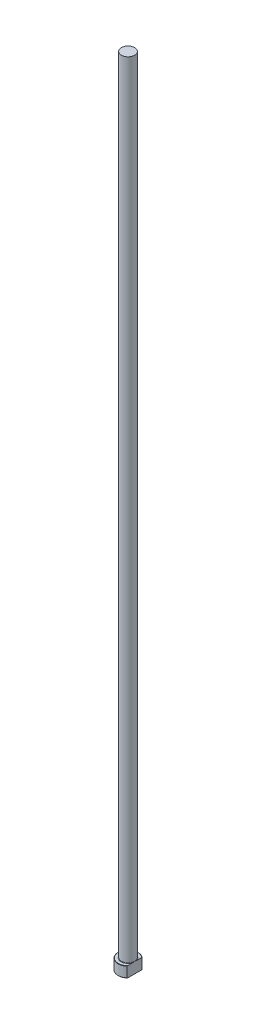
ISO-10303-21;
HEADER;
FILE_DESCRIPTION(('STEP AP214'),'2;1');
FILE_NAME('part.step','',(''),(''),'','','');
FILE_SCHEMA(('AUTOMOTIVE_DESIGN { 1 0 10303 214 1 1 1 1 }'));
ENDSEC;
DATA;
#1=APPLICATION_CONTEXT('core data for automotive mechanical design processes');
#2=APPLICATION_PROTOCOL_DEFINITION('international standard','automotive_design',2000,#1);
#3=PRODUCT_CONTEXT('',#1,'mechanical');
#4=PRODUCT('Part','Part','',(#3));
#5=PRODUCT_RELATED_PRODUCT_CATEGORY('part','',(#4));
#6=PRODUCT_DEFINITION_FORMATION('','',#4);
#7=PRODUCT_DEFINITION_CONTEXT('part definition',#1,'design');
#8=PRODUCT_DEFINITION('design','',#6,#7);
#9=PRODUCT_DEFINITION_SHAPE('','',#8);
#10=(LENGTH_UNIT() NAMED_UNIT(*) SI_UNIT(.MILLI.,.METRE.));
#11=(NAMED_UNIT(*) PLANE_ANGLE_UNIT() SI_UNIT($,.RADIAN.));
#12=(NAMED_UNIT(*) SI_UNIT($,.STERADIAN.) SOLID_ANGLE_UNIT());
#13=UNCERTAINTY_MEASURE_WITH_UNIT(LENGTH_MEASURE(1.E-05),#10,'distance_accuracy_value','');
#14=(GEOMETRIC_REPRESENTATION_CONTEXT(3) GLOBAL_UNCERTAINTY_ASSIGNED_CONTEXT((#13)) GLOBAL_UNIT_ASSIGNED_CONTEXT((#10,
#11,#12)) REPRESENTATION_CONTEXT('',''));
#15=CARTESIAN_POINT('',(0.,0.,0.));
#16=DIRECTION('',(0.,0.,1.));
#17=DIRECTION('',(1.,0.,0.));
#18=AXIS2_PLACEMENT_3D('',#15,#16,#17);
#19=CARTESIAN_POINT('',(0.,0.,0.));
#20=DIRECTION('',(0.,-1.,0.));
#21=DIRECTION('',(0.,0.,-1.));
#22=AXIS2_PLACEMENT_3D('',#19,#20,#21);
#23=PLANE('',#22);
#24=CARTESIAN_POINT('',(0.,0.,0.));
#25=DIRECTION('',(0.,-1.,0.));
#26=DIRECTION('',(0.,0.,-1.));
#27=AXIS2_PLACEMENT_3D('',#24,#25,#26);
#28=CIRCLE('',#27,7.29999999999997);
#29=CARTESIAN_POINT('',(4.99999999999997,0.,5.31883445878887));
#30=VERTEX_POINT('',#29);
#31=CARTESIAN_POINT('',(4.99999999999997,0.,-5.31883445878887));
#32=VERTEX_POINT('',#31);
#33=EDGE_CURVE('E98',#30,#32,#28,.T.);
#34=ORIENTED_EDGE('',*,*,#33,.T.);
#35=DIRECTION('',(0.,0.,1.));
#36=VECTOR('',#35,1.);
#37=CARTESIAN_POINT('',(4.99999999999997,0.,5.59016994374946));
#38=LINE('',#37,#36);
#39=EDGE_CURVE('E83',#32,#30,#38,.T.);
#40=ORIENTED_EDGE('',*,*,#39,.T.);
#41=EDGE_LOOP('',(#34,#40));
#42=FACE_BOUND('',#41,.T.);
#43=ADVANCED_FACE('F32',(#42),#23,.T.);
#44=CARTESIAN_POINT('',(0.,259.958771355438,0.));
#45=DIRECTION('',(0.,1.,0.));
#46=DIRECTION('',(0.,0.,1.));
#47=AXIS2_PLACEMENT_3D('',#44,#45,#46);
#48=CYLINDRICAL_SURFACE('',#47,7.49999999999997);
#49=CARTESIAN_POINT('',(0.,7.8000000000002,0.));
#50=DIRECTION('',(0.,1.,0.));
#51=DIRECTION('',(0.,0.,1.));
#52=AXIS2_PLACEMENT_3D('',#49,#50,#51);
#53=CIRCLE('',#52,7.49999999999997);
#54=CARTESIAN_POINT('',(4.99999999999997,7.8000000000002,5.59016994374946));
#55=VERTEX_POINT('',#54);
#56=CARTESIAN_POINT('',(4.99999999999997,7.8000000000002,-5.59016994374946));
#57=VERTEX_POINT('',#56);
#58=EDGE_CURVE('E104',#55,#57,#53,.F.);
#59=ORIENTED_EDGE('',*,*,#58,.T.);
#60=DIRECTION('',(0.,-1.,0.));
#61=VECTOR('',#60,1.);
#62=CARTESIAN_POINT('',(4.99999999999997,600.,-5.59016994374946));
#63=LINE('',#62,#61);
#64=CARTESIAN_POINT('',(4.99999999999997,0.199999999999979,-5.59016994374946));
#65=VERTEX_POINT('',#64);
#66=EDGE_CURVE('E183',#57,#65,#63,.T.);
#67=ORIENTED_EDGE('',*,*,#66,.T.);
#68=CARTESIAN_POINT('',(0.,0.199999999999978,0.));
#69=DIRECTION('',(0.,-1.,0.));
#70=DIRECTION('',(0.,0.,-1.));
#71=AXIS2_PLACEMENT_3D('',#68,#69,#70);
#72=CIRCLE('',#71,7.49999999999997);
#73=CARTESIAN_POINT('',(4.99999999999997,0.199999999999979,5.59016994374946));
#74=VERTEX_POINT('',#73);
#75=EDGE_CURVE('E100',#65,#74,#72,.F.);
#76=ORIENTED_EDGE('',*,*,#75,.T.);
#77=DIRECTION('',(0.,-1.,0.));
#78=VECTOR('',#77,1.);
#79=CARTESIAN_POINT('',(4.99999999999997,600.,5.59016994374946));
#80=LINE('',#79,#78);
#81=EDGE_CURVE('E93',#55,#74,#80,.T.);
#82=ORIENTED_EDGE('',*,*,#81,.F.);
#83=EDGE_LOOP('',(#59,#67,#76,#82));
#84=FACE_BOUND('',#83,.T.);
#85=ADVANCED_FACE('F158',(#84),#48,.T.);
#86=CARTESIAN_POINT('',(-7.49999999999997,8.,0.));
#87=DIRECTION('',(0.,1.,0.));
#88=DIRECTION('',(0.,0.,1.));
#89=AXIS2_PLACEMENT_3D('',#86,#87,#88);
#90=PLANE('',#89);
#91=CARTESIAN_POINT('',(0.,8.,0.));
#92=DIRECTION('',(0.,1.,0.));
#93=DIRECTION('',(0.,0.,1.));
#94=AXIS2_PLACEMENT_3D('',#91,#92,#93);
#95=CIRCLE('',#94,7.30000000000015);
#96=CARTESIAN_POINT('',(4.99999999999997,8.,-5.31883445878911));
#97=VERTEX_POINT('',#96);
#98=CARTESIAN_POINT('',(4.99999999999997,8.,5.31883445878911));
#99=VERTEX_POINT('',#98);
#100=EDGE_CURVE('E178',#97,#99,#95,.T.);
#101=ORIENTED_EDGE('',*,*,#100,.T.);
#102=DIRECTION('',(0.,0.,-1.));
#103=VECTOR('',#102,1.);
#104=CARTESIAN_POINT('',(4.99999999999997,8.,0.));
#105=LINE('',#104,#103);
#106=CARTESIAN_POINT('',(4.99999999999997,7.99999999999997,1.75783958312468));
#107=VERTEX_POINT('',#106);
#108=EDGE_CURVE('E57',#99,#107,#105,.T.);
#109=ORIENTED_EDGE('',*,*,#108,.T.);
#110=CARTESIAN_POINT('',(0.,8.,0.));
#111=DIRECTION('',(0.,1.,0.));
#112=DIRECTION('',(0.,0.,1.));
#113=AXIS2_PLACEMENT_3D('',#110,#111,#112);
#114=CIRCLE('',#113,5.29999999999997);
#115=CARTESIAN_POINT('',(4.99999999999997,7.99999999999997,-1.75783958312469));
#116=VERTEX_POINT('',#115);
#117=EDGE_CURVE('E107',#107,#116,#114,.F.);
#118=ORIENTED_EDGE('',*,*,#117,.T.);
#119=EDGE_CURVE('E136',#116,#97,#105,.T.);
#120=ORIENTED_EDGE('',*,*,#119,.T.);
#121=EDGE_LOOP('',(#101,#109,#118,#120));
#122=FACE_BOUND('',#121,.T.);
#123=ADVANCED_FACE('F147',(#122),#90,.T.);
#124=CARTESIAN_POINT('',(0.,8.00000000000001,0.));
#125=DIRECTION('',(0.,-1.,0.));
#126=DIRECTION('',(0.,0.,-1.));
#127=AXIS2_PLACEMENT_3D('',#124,#125,#126);
#128=CONICAL_SURFACE('',#127,7.30000000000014,0.785398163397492);
#129=ORIENTED_EDGE('',*,*,#58,.F.);
#130=CARTESIAN_POINT('',(4.99999999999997,2.02290246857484,12.2996471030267));
#131=CARTESIAN_POINT('',(4.99999999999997,2.19416619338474,12.1147698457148));
#132=CARTESIAN_POINT('',(4.99999999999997,2.3651387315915,11.9296229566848));
#133=CARTESIAN_POINT('',(4.99999999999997,2.70641198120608,11.5587086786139));
#134=CARTESIAN_POINT('',(4.99999999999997,2.8767126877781,11.3729412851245));
#135=CARTESIAN_POINT('',(4.99999999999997,3.38654214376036,10.8145105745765));
#136=CARTESIAN_POINT('',(4.99999999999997,3.72492462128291,10.4407980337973));
#137=CARTESIAN_POINT('',(4.99999999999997,4.39960399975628,9.68746107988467));
#138=CARTESIAN_POINT('',(4.99999999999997,4.73587640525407,9.30781469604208));
#139=CARTESIAN_POINT('',(4.99999999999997,5.40266300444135,8.54355414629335));
#140=CARTESIAN_POINT('',(4.99999999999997,5.73317787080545,8.15894056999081));
#141=CARTESIAN_POINT('',(4.99999999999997,6.32050616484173,7.4605234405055));
#142=CARTESIAN_POINT('',(4.99999999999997,6.57881367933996,7.14797875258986));
#143=CARTESIAN_POINT('',(4.99999999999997,7.08815745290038,6.51684714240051));
#144=CARTESIAN_POINT('',(4.99999999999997,7.33919194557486,6.19825878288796));
#145=CARTESIAN_POINT('',(4.99999999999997,7.70761642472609,5.71446312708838));
#146=CARTESIAN_POINT('',(4.99999999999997,7.82900589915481,5.55230264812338));
#147=CARTESIAN_POINT('',(4.99999999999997,8.06851378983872,5.22558802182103));
#148=CARTESIAN_POINT('',(4.99999999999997,8.18663235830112,5.06103398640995));
#149=CARTESIAN_POINT('',(4.99999999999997,8.41879851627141,4.72916340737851));
#150=CARTESIAN_POINT('',(4.99999999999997,8.53284764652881,4.56184794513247));
#151=CARTESIAN_POINT('',(4.99999999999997,8.7559029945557,4.22389957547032));
#152=CARTESIAN_POINT('',(4.99999999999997,8.86490976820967,4.05326703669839));
#153=CARTESIAN_POINT('',(4.99999999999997,9.07352802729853,3.71301730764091));
#154=CARTESIAN_POINT('',(4.99999999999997,9.17331912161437,3.54351083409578));
#155=CARTESIAN_POINT('',(4.99999999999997,9.36528183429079,3.20017857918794));
#156=CARTESIAN_POINT('',(4.99999999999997,9.4574526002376,3.02635231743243));
#157=CARTESIAN_POINT('',(4.99999999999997,9.63197812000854,2.67392882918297));
#158=CARTESIAN_POINT('',(4.99999999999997,9.71433885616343,2.49533459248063));
#159=CARTESIAN_POINT('',(4.99999999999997,9.86657328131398,2.13287211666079));
#160=CARTESIAN_POINT('',(4.99999999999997,9.93645048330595,1.94900537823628));
#161=CARTESIAN_POINT('',(4.99999999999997,10.0468845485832,1.61681363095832));
#162=CARTESIAN_POINT('',(4.99999999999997,10.0905114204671,1.46951511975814));
#163=CARTESIAN_POINT('',(4.99999999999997,10.1664777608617,1.17205123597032));
#164=CARTESIAN_POINT('',(4.99999999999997,10.1988213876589,1.02188694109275));
#165=CARTESIAN_POINT('',(4.99999999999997,10.2506360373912,0.719811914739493));
#166=CARTESIAN_POINT('',(4.99999999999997,10.270147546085,0.567908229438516));
#167=CARTESIAN_POINT('',(4.99999999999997,10.2953955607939,0.262949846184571));
#168=CARTESIAN_POINT('',(4.99999999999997,10.3011328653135,0.109895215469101));
#169=CARTESIAN_POINT('',(4.99999999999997,10.2984919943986,-0.196515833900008));
#170=CARTESIAN_POINT('',(4.99999999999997,10.290074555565,-0.349871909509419));
#171=CARTESIAN_POINT('',(4.99999999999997,10.2595435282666,-0.655203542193));
#172=CARTESIAN_POINT('',(4.99999999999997,10.2374288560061,-0.807178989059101));
#173=CARTESIAN_POINT('',(4.99999999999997,10.1805990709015,-1.10921231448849));
#174=CARTESIAN_POINT('',(4.99999999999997,10.1458448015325,-1.25926271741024));
#175=CARTESIAN_POINT('',(4.99999999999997,10.0653312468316,-1.55634789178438));
#176=CARTESIAN_POINT('',(4.99999999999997,10.019571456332,-1.70338252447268));
#177=CARTESIAN_POINT('',(4.99999999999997,9.91304201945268,-2.0105606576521));
#178=CARTESIAN_POINT('',(4.99999999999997,9.85116243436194,-2.17031597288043));
#179=CARTESIAN_POINT('',(4.99999999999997,9.71797424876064,-2.48585686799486));
#180=CARTESIAN_POINT('',(4.99999999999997,9.646662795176,-2.64164122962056));
#181=CARTESIAN_POINT('',(4.99999999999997,9.49630859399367,-2.94973647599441));
#182=CARTESIAN_POINT('',(4.99999999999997,9.4172527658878,-3.10204092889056));
#183=CARTESIAN_POINT('',(4.99999999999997,9.25299983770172,-3.40325483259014));
#184=CARTESIAN_POINT('',(4.99999999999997,9.16780351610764,-3.55216471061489));
#185=CARTESIAN_POINT('',(4.99999999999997,8.99132919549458,-3.84886097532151));
#186=CARTESIAN_POINT('',(4.99999999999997,8.89998823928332,-3.99660974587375));
#187=CARTESIAN_POINT('',(4.99999999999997,8.7131451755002,-4.2894450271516));
#188=CARTESIAN_POINT('',(4.99999999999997,8.61764297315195,-4.43453147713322));
#189=CARTESIAN_POINT('',(4.99999999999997,8.32624270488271,-4.86605322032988));
#190=CARTESIAN_POINT('',(4.99999999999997,8.12526518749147,-5.1490561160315));
#191=CARTESIAN_POINT('',(4.99999999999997,7.6894794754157,-5.74150232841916));
#192=CARTESIAN_POINT('',(4.99999999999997,7.45349590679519,-6.05007152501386));
#193=CARTESIAN_POINT('',(4.99999999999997,6.97343103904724,-6.66088013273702));
#194=CARTESIAN_POINT('',(4.99999999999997,6.72934863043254,-6.96311866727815));
#195=CARTESIAN_POINT('',(4.99999999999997,6.23516699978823,-7.56307522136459));
#196=CARTESIAN_POINT('',(4.99999999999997,5.98506253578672,-7.86078890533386));
#197=CARTESIAN_POINT('',(4.99999999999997,5.48054649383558,-8.45254667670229));
#198=CARTESIAN_POINT('',(4.99999999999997,5.22613481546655,-8.74659067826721));
#199=CARTESIAN_POINT('',(4.99999999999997,4.72865534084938,-9.31510244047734));
#200=CARTESIAN_POINT('',(4.99999999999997,4.48576913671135,-9.58972942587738));
#201=CARTESIAN_POINT('',(4.99999999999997,3.99769198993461,-10.1369350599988));
#202=CARTESIAN_POINT('',(4.99999999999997,3.75250100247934,-10.4095136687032));
#203=CARTESIAN_POINT('',(4.99999999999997,3.26075538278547,-10.952472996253));
#204=CARTESIAN_POINT('',(4.99999999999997,3.01420432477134,-11.2228569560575));
#205=CARTESIAN_POINT('',(4.99999999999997,2.51960108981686,-11.762227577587));
#206=CARTESIAN_POINT('',(4.99999999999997,2.27154897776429,-12.0312142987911));
#207=CARTESIAN_POINT('',(4.99999999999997,2.02290246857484,-12.2996471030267));
#208=B_SPLINE_CURVE_WITH_KNOTS('',3,(#130,#131,#132,#133,#134,#135,#136,#137,#138,#139,#140,
#141,#142,#143,#144,#145,#146,#147,#148,#149,#150,#151,#152,#153,#154,#155,#156,#157,#158,#159,
#160,#161,#162,#163,#164,#165,#166,#167,#168,#169,#170,#171,#172,#173,#174,#175,#176,#177,#178,
#179,#180,#181,#182,#183,#184,#185,#186,#187,#188,#189,#190,#191,#192,#193,#194,#195,#196,#197,
#198,#199,#200,#201,#202,#203,#204,#205,#206,#207),.UNSPECIFIED.,.F.,.F.,(4,2,2,2,2,2,2,2,2,2,2,
2,2,2,2,2,2,2,2,2,2,2,2,2,2,2,2,2,2,2,2,2,2,2,2,2,2,2,4),(0.,0.756040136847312,1.5120857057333,
3.02450144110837,4.54594242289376,6.0672044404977,7.28354986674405,8.50018826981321,
9.10784347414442,9.7154703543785,10.3228646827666,10.9301918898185,11.5201366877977,
12.110147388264,12.6997964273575,13.2892792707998,13.7497741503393,14.2100991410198,
14.6689647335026,15.1278037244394,15.5879175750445,16.0480678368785,16.5096559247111,
16.9712652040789,17.4848523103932,17.9985951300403,18.5132211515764,19.0277820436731,
19.5488073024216,20.0698444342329,21.1108480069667,22.2760591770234,23.4414306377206,
24.6078560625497,25.7743087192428,26.8741673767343,27.9740474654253,29.0717909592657,
30.1694873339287),.UNSPECIFIED.);
#209=EDGE_CURVE('E135',#55,#99,#208,.T.);
#210=ORIENTED_EDGE('',*,*,#209,.T.);
#211=ORIENTED_EDGE('',*,*,#100,.F.);
#212=EDGE_CURVE('E127',#97,#57,#208,.T.);
#213=ORIENTED_EDGE('',*,*,#212,.T.);
#214=EDGE_LOOP('',(#129,#210,#211,#213));
#215=FACE_BOUND('',#214,.T.);
#216=ADVANCED_FACE('F143',(#215),#128,.T.);
#217=CARTESIAN_POINT('',(0.,0.199999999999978,0.));
#218=DIRECTION('',(0.,1.,0.));
#219=DIRECTION('',(0.,0.,1.));
#220=AXIS2_PLACEMENT_3D('',#217,#218,#219);
#221=CONICAL_SURFACE('',#220,7.49999999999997,0.785398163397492);
#222=ORIENTED_EDGE('',*,*,#75,.F.);
#223=CARTESIAN_POINT('',(4.99999999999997,5.97709753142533,-12.2996471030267));
#224=CARTESIAN_POINT('',(4.99999999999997,5.80583380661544,-12.1147698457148));
#225=CARTESIAN_POINT('',(4.99999999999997,5.63486126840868,-11.9296229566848));
#226=CARTESIAN_POINT('',(4.99999999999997,5.29358801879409,-11.5587086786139));
#227=CARTESIAN_POINT('',(4.99999999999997,5.12328731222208,-11.3729412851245));
#228=CARTESIAN_POINT('',(4.99999999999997,4.61345785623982,-10.8145105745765));
#229=CARTESIAN_POINT('',(4.99999999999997,4.27507537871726,-10.4407980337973));
#230=CARTESIAN_POINT('',(4.99999999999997,3.6003960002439,-9.68746107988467));
#231=CARTESIAN_POINT('',(4.99999999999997,3.2641235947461,-9.30781469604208));
#232=CARTESIAN_POINT('',(4.99999999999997,2.59733699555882,-8.54355414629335));
#233=CARTESIAN_POINT('',(4.99999999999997,2.26682212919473,-8.15894056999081));
#234=CARTESIAN_POINT('',(4.99999999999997,1.67949383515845,-7.4605234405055));
#235=CARTESIAN_POINT('',(4.99999999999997,1.42118632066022,-7.14797875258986));
#236=CARTESIAN_POINT('',(4.99999999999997,0.911842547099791,-6.51684714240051));
#237=CARTESIAN_POINT('',(4.99999999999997,0.660808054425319,-6.19825878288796));
#238=CARTESIAN_POINT('',(4.99999999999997,0.292383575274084,-5.71446312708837));
#239=CARTESIAN_POINT('',(4.99999999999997,0.170994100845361,-5.55230264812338));
#240=CARTESIAN_POINT('',(4.99999999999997,-0.0685137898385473,-5.22558802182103));
#241=CARTESIAN_POINT('',(4.99999999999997,-0.186632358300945,-5.06103398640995));
#242=CARTESIAN_POINT('',(4.99999999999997,-0.418798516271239,-4.7291634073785));
#243=CARTESIAN_POINT('',(4.99999999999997,-0.532847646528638,-4.56184794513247));
#244=CARTESIAN_POINT('',(4.99999999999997,-0.755902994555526,-4.22389957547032));
#245=CARTESIAN_POINT('',(4.99999999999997,-0.864909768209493,-4.05326703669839));
#246=CARTESIAN_POINT('',(4.99999999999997,-1.07352802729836,-3.71301730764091));
#247=CARTESIAN_POINT('',(4.99999999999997,-1.17331912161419,-3.54351083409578));
#248=CARTESIAN_POINT('',(4.99999999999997,-1.36528183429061,-3.20017857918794));
#249=CARTESIAN_POINT('',(4.99999999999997,-1.45745260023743,-3.02635231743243));
#250=CARTESIAN_POINT('',(4.99999999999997,-1.63197812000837,-2.67392882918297));
#251=CARTESIAN_POINT('',(4.99999999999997,-1.71433885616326,-2.49533459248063));
#252=CARTESIAN_POINT('',(4.99999999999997,-1.8665732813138,-2.13287211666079));
#253=CARTESIAN_POINT('',(4.99999999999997,-1.93645048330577,-1.94900537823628));
#254=CARTESIAN_POINT('',(4.99999999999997,-2.04688454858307,-1.61681363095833));
#255=CARTESIAN_POINT('',(4.99999999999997,-2.09051142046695,-1.46951511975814));
#256=CARTESIAN_POINT('',(4.99999999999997,-2.16647776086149,-1.17205123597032));
#257=CARTESIAN_POINT('',(4.99999999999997,-2.19882138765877,-1.02188694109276));
#258=CARTESIAN_POINT('',(4.99999999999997,-2.250636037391,-0.719811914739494));
#259=CARTESIAN_POINT('',(4.99999999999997,-2.27014754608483,-0.567908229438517));
#260=CARTESIAN_POINT('',(4.99999999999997,-2.29539556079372,-0.262949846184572));
#261=CARTESIAN_POINT('',(4.99999999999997,-2.30113286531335,-0.109895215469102));
#262=CARTESIAN_POINT('',(4.99999999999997,-2.29849199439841,0.196515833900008));
#263=CARTESIAN_POINT('',(4.99999999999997,-2.29007455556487,0.349871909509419));
#264=CARTESIAN_POINT('',(4.99999999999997,-2.25954352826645,0.655203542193));
#265=CARTESIAN_POINT('',(4.99999999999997,-2.23742885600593,0.807178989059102));
#266=CARTESIAN_POINT('',(4.99999999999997,-2.18059907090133,1.10921231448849));
#267=CARTESIAN_POINT('',(4.99999999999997,-2.14584480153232,1.25926271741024));
#268=CARTESIAN_POINT('',(4.99999999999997,-2.06533124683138,1.55634789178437));
#269=CARTESIAN_POINT('',(4.99999999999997,-2.01957145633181,1.70338252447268));
#270=CARTESIAN_POINT('',(4.99999999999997,-1.9130420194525,2.0105606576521));
#271=CARTESIAN_POINT('',(4.99999999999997,-1.85116243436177,2.17031597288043));
#272=CARTESIAN_POINT('',(4.99999999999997,-1.71797424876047,2.48585686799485));
#273=CARTESIAN_POINT('',(4.99999999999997,-1.64666279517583,2.64164122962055));
#274=CARTESIAN_POINT('',(4.99999999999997,-1.4963085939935,2.94973647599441));
#275=CARTESIAN_POINT('',(4.99999999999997,-1.41725276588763,3.10204092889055));
#276=CARTESIAN_POINT('',(4.99999999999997,-1.25299983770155,3.40325483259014));
#277=CARTESIAN_POINT('',(4.99999999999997,-1.16780351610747,3.55216471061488));
#278=CARTESIAN_POINT('',(4.99999999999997,-0.991329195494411,3.8488609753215));
#279=CARTESIAN_POINT('',(4.99999999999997,-0.899988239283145,3.99660974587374));
#280=CARTESIAN_POINT('',(4.99999999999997,-0.71314517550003,4.2894450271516));
#281=CARTESIAN_POINT('',(4.99999999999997,-0.617642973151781,4.43453147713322));
#282=CARTESIAN_POINT('',(4.99999999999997,-0.326242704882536,4.86605322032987));
#283=CARTESIAN_POINT('',(4.99999999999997,-0.125265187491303,5.14905611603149));
#284=CARTESIAN_POINT('',(4.99999999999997,0.310520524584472,5.74150232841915));
#285=CARTESIAN_POINT('',(4.99999999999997,0.546504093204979,6.05007152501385));
#286=CARTESIAN_POINT('',(4.99999999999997,1.02656896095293,6.66088013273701));
#287=CARTESIAN_POINT('',(4.99999999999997,1.27065136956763,6.96311866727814));
#288=CARTESIAN_POINT('',(4.99999999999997,1.76483300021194,7.56307522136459));
#289=CARTESIAN_POINT('',(4.99999999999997,2.01493746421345,7.86078890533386));
#290=CARTESIAN_POINT('',(4.99999999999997,2.51945350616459,8.45254667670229));
#291=CARTESIAN_POINT('',(4.99999999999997,2.77386518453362,8.74659067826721));
#292=CARTESIAN_POINT('',(4.99999999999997,3.27134465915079,9.31510244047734));
#293=CARTESIAN_POINT('',(4.99999999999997,3.51423086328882,9.58972942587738));
#294=CARTESIAN_POINT('',(4.99999999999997,4.00230801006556,10.1369350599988));
#295=CARTESIAN_POINT('',(4.99999999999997,4.24749899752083,10.4095136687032));
#296=CARTESIAN_POINT('',(4.99999999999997,4.7392446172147,10.952472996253));
#297=CARTESIAN_POINT('',(4.99999999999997,4.98579567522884,11.2228569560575));
#298=CARTESIAN_POINT('',(4.99999999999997,5.48039891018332,11.762227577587));
#299=CARTESIAN_POINT('',(4.99999999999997,5.72845102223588,12.0312142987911));
#300=CARTESIAN_POINT('',(4.99999999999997,5.97709753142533,12.2996471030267));
#301=B_SPLINE_CURVE_WITH_KNOTS('',3,(#223,#224,#225,#226,#227,#228,#229,#230,#231,#232,#233,
#234,#235,#236,#237,#238,#239,#240,#241,#242,#243,#244,#245,#246,#247,#248,#249,#250,#251,#252,
#253,#254,#255,#256,#257,#258,#259,#260,#261,#262,#263,#264,#265,#266,#267,#268,#269,#270,#271,
#272,#273,#274,#275,#276,#277,#278,#279,#280,#281,#282,#283,#284,#285,#286,#287,#288,#289,#290,
#291,#292,#293,#294,#295,#296,#297,#298,#299,#300),.UNSPECIFIED.,.F.,.F.,(4,2,2,2,2,2,2,2,2,2,2,
2,2,2,2,2,2,2,2,2,2,2,2,2,2,2,2,2,2,2,2,2,2,2,2,2,2,2,4),(0.,0.756040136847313,1.5120857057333,
3.02450144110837,4.54594242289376,6.0672044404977,7.28354986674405,8.50018826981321,
9.10784347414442,9.71547035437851,10.3228646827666,10.9301918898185,11.5201366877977,
12.110147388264,12.6997964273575,13.2892792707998,13.7497741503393,14.2100991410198,
14.6689647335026,15.1278037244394,15.5879175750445,16.0480678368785,16.5096559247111,
16.9712652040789,17.4848523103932,17.9985951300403,18.5132211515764,19.0277820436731,
19.5488073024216,20.0698444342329,21.1108480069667,22.2760591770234,23.4414306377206,
24.6078560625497,25.7743087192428,26.8741673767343,27.9740474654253,29.0717909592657,
30.1694873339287),.UNSPECIFIED.);
#302=EDGE_CURVE('E86',#65,#32,#301,.T.);
#303=ORIENTED_EDGE('',*,*,#302,.T.);
#304=ORIENTED_EDGE('',*,*,#33,.F.);
#305=EDGE_CURVE('E89',#30,#74,#301,.T.);
#306=ORIENTED_EDGE('',*,*,#305,.T.);
#307=EDGE_LOOP('',(#222,#303,#304,#306));
#308=FACE_BOUND('',#307,.T.);
#309=ADVANCED_FACE('F97',(#308),#221,.T.);
#310=CARTESIAN_POINT('',(0.,8.29999999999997,0.));
#311=DIRECTION('',(0.,1.,0.));
#312=DIRECTION('',(0.,0.,1.));
#313=AXIS2_PLACEMENT_3D('',#310,#311,#312);
#314=TOROIDAL_SURFACE('',#313,5.29999999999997,0.3);
#315=CARTESIAN_POINT('',(4.99999999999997,8.29999999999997,0.));
#316=CARTESIAN_POINT('',(4.99999999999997,8.30000062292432,1.3146948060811E-10));
#317=CARTESIAN_POINT('',(4.99999999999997,8.30000124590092,-2.52759224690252E-07));
#318=CARTESIAN_POINT('',(4.99999999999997,8.30000240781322,-9.47164357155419E-07));
#319=CARTESIAN_POINT('',(4.99999999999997,8.30000293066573,-1.40594039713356E-06));
#320=CARTESIAN_POINT('',(4.99999999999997,8.30000402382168,-2.50637608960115E-06));
#321=CARTESIAN_POINT('',(4.99999999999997,8.30000457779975,-3.16588911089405E-06));
#322=CARTESIAN_POINT('',(4.99999999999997,8.30000556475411,-4.52859968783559E-06));
#323=CARTESIAN_POINT('',(4.99999999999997,8.30000600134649,-5.22939450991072E-06));
#324=CARTESIAN_POINT('',(4.99999999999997,8.30000763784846,-7.96121989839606E-06));
#325=CARTESIAN_POINT('',(4.99999999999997,8.30000875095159,-1.00477409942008E-05));
#326=CARTESIAN_POINT('',(4.99999999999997,8.30001056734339,-1.41660874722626E-05));
#327=CARTESIAN_POINT('',(4.99999999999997,8.30001129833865,-1.61861784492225E-05));
#328=CARTESIAN_POINT('',(4.99999999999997,8.30001439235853,-2.4786574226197E-05));
#329=CARTESIAN_POINT('',(4.99999999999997,8.30001672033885,-3.13830284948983E-05));
#330=CARTESIAN_POINT('',(4.99999999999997,8.30002012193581,-4.3808422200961E-05));
#331=CARTESIAN_POINT('',(4.99999999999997,8.30002133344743,-4.95992740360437E-05));
#332=CARTESIAN_POINT('',(4.99999999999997,8.30003020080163,-9.27862616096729E-05));
#333=CARTESIAN_POINT('',(4.99999999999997,8.30003696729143,-0.000130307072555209));
#334=CARTESIAN_POINT('',(4.99999999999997,8.30006659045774,-0.000278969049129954));
#335=CARTESIAN_POINT('',(4.99999999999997,8.30009481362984,-0.000389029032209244));
#336=CARTESIAN_POINT('',(4.99999999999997,8.30020506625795,-0.000826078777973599));
#337=CARTESIAN_POINT('',(4.99999999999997,8.3002836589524,-0.00115365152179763));
#338=CARTESIAN_POINT('',(4.99999999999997,8.30059919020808,-0.00245925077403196));
#339=CARTESIAN_POINT('',(4.99999999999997,8.30084048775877,-0.00343651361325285));
#340=CARTESIAN_POINT('',(4.99999999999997,8.30184626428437,-0.00752058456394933));
#341=CARTESIAN_POINT('',(4.99999999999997,8.3026052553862,-0.0106283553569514));
#342=CARTESIAN_POINT('',(4.99999999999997,8.30996461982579,-0.0407482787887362));
#343=CARTESIAN_POINT('',(4.99999999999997,8.31658985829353,-0.0677561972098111));
#344=CARTESIAN_POINT('',(4.99999999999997,8.32953319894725,-0.120688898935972));
#345=CARTESIAN_POINT('',(4.99999999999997,8.33585289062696,-0.146613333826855));
#346=CARTESIAN_POINT('',(4.99999999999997,8.34926050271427,-0.201795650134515));
#347=CARTESIAN_POINT('',(4.99999999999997,8.35634306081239,-0.231054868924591));
#348=CARTESIAN_POINT('',(4.99999999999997,8.37050252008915,-0.289917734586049));
#349=CARTESIAN_POINT('',(4.99999999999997,8.3775784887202,-0.319521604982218));
#350=CARTESIAN_POINT('',(4.99999999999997,8.39452602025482,-0.391032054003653));
#351=CARTESIAN_POINT('',(4.99999999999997,8.40434071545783,-0.432952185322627));
#352=CARTESIAN_POINT('',(4.99999999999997,8.42340141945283,-0.515763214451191));
#353=CARTESIAN_POINT('',(4.99999999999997,8.43265559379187,-0.556652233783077));
#354=CARTESIAN_POINT('',(4.99999999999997,8.45710553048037,-0.667075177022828));
#355=CARTESIAN_POINT('',(4.99999999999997,8.47194176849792,-0.736689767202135));
#356=CARTESIAN_POINT('',(4.99999999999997,8.50018229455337,-0.876836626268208));
#357=CARTESIAN_POINT('',(4.99999999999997,8.51357312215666,-0.947371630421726));
#358=CARTESIAN_POINT('',(4.99999999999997,8.53930921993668,-1.09497328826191));
#359=CARTESIAN_POINT('',(4.99999999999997,8.55146217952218,-1.17207432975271));
#360=CARTESIAN_POINT('',(4.99999999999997,8.5723966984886,-1.32672649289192));
#361=CARTESIAN_POINT('',(4.99999999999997,8.58117877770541,-1.4042775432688));
#362=CARTESIAN_POINT('',(4.99999999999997,8.59499725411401,-1.56873827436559));
#363=CARTESIAN_POINT('',(4.99999999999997,8.59948802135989,-1.65570044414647));
#364=CARTESIAN_POINT('',(4.99999999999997,8.60018885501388,-1.78535304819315));
#365=CARTESIAN_POINT('',(4.99999999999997,8.59945214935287,-1.82802575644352));
#366=CARTESIAN_POINT('',(4.99999999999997,8.59559364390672,-1.91325081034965));
#367=CARTESIAN_POINT('',(4.99999999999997,8.59247319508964,-1.95580321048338));
#368=CARTESIAN_POINT('',(4.99999999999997,8.58383242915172,-2.03512365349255));
#369=CARTESIAN_POINT('',(4.99999999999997,8.57867386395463,-2.07192937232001));
#370=CARTESIAN_POINT('',(4.99999999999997,8.56543793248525,-2.14526756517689));
#371=CARTESIAN_POINT('',(4.99999999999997,8.55734203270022,-2.18179676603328));
#372=CARTESIAN_POINT('',(4.99999999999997,8.53718005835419,-2.25427226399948));
#373=CARTESIAN_POINT('',(4.99999999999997,8.52507057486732,-2.29020746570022));
#374=CARTESIAN_POINT('',(4.99999999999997,8.5027092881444,-2.34223029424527));
#375=CARTESIAN_POINT('',(4.99999999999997,8.49457811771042,-2.35922314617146));
#376=CARTESIAN_POINT('',(4.99999999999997,8.47657809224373,-2.39224900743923));
#377=CARTESIAN_POINT('',(4.99999999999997,8.46671281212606,-2.40828390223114));
#378=CARTESIAN_POINT('',(4.99999999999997,8.44695893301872,-2.43579467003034));
#379=CARTESIAN_POINT('',(4.99999999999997,8.4374587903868,-2.44754592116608));
#380=CARTESIAN_POINT('',(4.99999999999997,8.41677914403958,-2.4694647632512));
#381=CARTESIAN_POINT('',(4.99999999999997,8.40560543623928,-2.47963758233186));
#382=CARTESIAN_POINT('',(4.99999999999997,8.38617750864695,-2.49393642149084));
#383=CARTESIAN_POINT('',(4.99999999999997,8.37851643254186,-2.49886271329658));
#384=CARTESIAN_POINT('',(4.99999999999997,8.36252740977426,-2.50749953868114));
#385=CARTESIAN_POINT('',(4.99999999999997,8.35419984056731,-2.51121075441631));
#386=CARTESIAN_POINT('',(4.99999999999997,8.33690648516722,-2.5171294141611));
#387=CARTESIAN_POINT('',(4.99999999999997,8.32793451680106,-2.51931927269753));
#388=CARTESIAN_POINT('',(4.99999999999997,8.30973576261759,-2.52185978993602));
#389=CARTESIAN_POINT('',(4.99999999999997,8.30050931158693,-2.52221275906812));
#390=CARTESIAN_POINT('',(4.99999999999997,8.2834916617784,-2.52112455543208));
#391=CARTESIAN_POINT('',(4.99999999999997,8.27568322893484,-2.51993178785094));
#392=CARTESIAN_POINT('',(4.99999999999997,8.26036860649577,-2.51628294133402));
#393=CARTESIAN_POINT('',(4.99999999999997,8.25286261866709,-2.51382603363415));
#394=CARTESIAN_POINT('',(4.99999999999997,8.2359026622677,-2.50685484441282));
#395=CARTESIAN_POINT('',(4.99999999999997,8.22661875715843,-2.50192984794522));
#396=CARTESIAN_POINT('',(4.99999999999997,8.20895514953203,-2.4906654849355));
#397=CARTESIAN_POINT('',(4.99999999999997,8.20057756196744,-2.48432291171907));
#398=CARTESIAN_POINT('',(4.99999999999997,8.1798700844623,-2.46645212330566));
#399=CARTESIAN_POINT('',(4.99999999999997,8.16824151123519,-2.45411867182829));
#400=CARTESIAN_POINT('',(4.99999999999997,8.1469246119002,-2.42790849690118));
#401=CARTESIAN_POINT('',(4.99999999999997,8.13723987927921,-2.41402898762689));
#402=CARTESIAN_POINT('',(4.99999999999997,8.11080706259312,-2.37143175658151));
#403=CARTESIAN_POINT('',(4.99999999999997,8.09628770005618,-2.34134703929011));
#404=CARTESIAN_POINT('',(4.99999999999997,8.07130349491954,-2.27940731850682));
#405=CARTESIAN_POINT('',(4.99999999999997,8.06087110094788,-2.24754035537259));
#406=CARTESIAN_POINT('',(4.99999999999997,8.03890359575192,-2.16787245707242));
#407=CARTESIAN_POINT('',(4.99999999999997,8.02913523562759,-2.11959065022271));
#408=CARTESIAN_POINT('',(4.99999999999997,8.01416953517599,-2.02224928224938));
#409=CARTESIAN_POINT('',(4.99999999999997,8.00898637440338,-1.97318778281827));
#410=CARTESIAN_POINT('',(4.99999999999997,8.00220823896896,-1.87635767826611));
#411=CARTESIAN_POINT('',(4.99999999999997,8.00050709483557,-1.82859609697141));
#412=CARTESIAN_POINT('',(4.99999999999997,7.99969104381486,-1.73330165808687));
#413=CARTESIAN_POINT('',(4.99999999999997,8.00056327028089,-1.68576884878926));
#414=CARTESIAN_POINT('',(4.99999999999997,8.00484296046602,-1.57937770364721));
#415=CARTESIAN_POINT('',(4.99999999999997,8.00880932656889,-1.52054285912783));
#416=CARTESIAN_POINT('',(4.99999999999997,8.01925964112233,-1.4031297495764));
#417=CARTESIAN_POINT('',(4.99999999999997,8.02574264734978,-1.34455139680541));
#418=CARTESIAN_POINT('',(4.99999999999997,8.0409008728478,-1.22627662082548));
#419=CARTESIAN_POINT('',(4.99999999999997,8.04962425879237,-1.16658647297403));
#420=CARTESIAN_POINT('',(4.99999999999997,8.0687792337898,-1.04732463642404));
#421=CARTESIAN_POINT('',(4.99999999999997,8.0792152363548,-0.987753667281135));
#422=CARTESIAN_POINT('',(4.99999999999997,8.10551698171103,-0.846936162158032));
#423=CARTESIAN_POINT('',(4.99999999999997,8.12196565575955,-0.765799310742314));
#424=CARTESIAN_POINT('',(4.99999999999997,8.15639716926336,-0.604819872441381));
#425=CARTESIAN_POINT('',(4.99999999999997,8.1743605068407,-0.524973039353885));
#426=CARTESIAN_POINT('',(4.99999999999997,8.20921667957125,-0.374726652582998));
#427=CARTESIAN_POINT('',(4.99999999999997,8.22599388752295,-0.304300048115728));
#428=CARTESIAN_POINT('',(4.99999999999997,8.25191105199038,-0.196907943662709));
#429=CARTESIAN_POINT('',(4.99999999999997,8.26090146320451,-0.15990571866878));
#430=CARTESIAN_POINT('',(4.99999999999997,8.27881854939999,-0.0865164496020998));
#431=CARTESIAN_POINT('',(4.99999999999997,8.28774391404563,-0.0501291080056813));
#432=CARTESIAN_POINT('',(4.99999999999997,8.29739627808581,-0.0106218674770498));
#433=CARTESIAN_POINT('',(4.99999999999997,8.29815688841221,-0.00750762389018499));
#434=CARTESIAN_POINT('',(4.99999999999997,8.29916304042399,-0.00342209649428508));
#435=CARTESIAN_POINT('',(4.99999999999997,8.29940309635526,-0.00244985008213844));
#436=CARTESIAN_POINT('',(4.99999999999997,8.29971711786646,-0.00115049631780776));
#437=CARTESIAN_POINT('',(4.99999999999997,8.29979541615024,-0.000824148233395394));
#438=CARTESIAN_POINT('',(4.99999999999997,8.29990531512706,-0.000388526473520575));
#439=CARTESIAN_POINT('',(4.99999999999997,8.29993348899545,-0.000278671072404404));
#440=CARTESIAN_POINT('',(4.99999999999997,8.2999630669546,-0.000130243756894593));
#441=CARTESIAN_POINT('',(4.99999999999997,8.29996982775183,-9.27511380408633E-05));
#442=CARTESIAN_POINT('',(4.99999999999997,8.29997868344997,-4.95929890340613E-05));
#443=CARTESIAN_POINT('',(4.99999999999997,8.29997989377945,-4.38036556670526E-05));
#444=CARTESIAN_POINT('',(4.99999999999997,8.29998329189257,-3.1381418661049E-05));
#445=CARTESIAN_POINT('',(4.99999999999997,8.2999856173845,-2.47865220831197E-05));
#446=CARTESIAN_POINT('',(4.99999999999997,8.29998870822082,-1.61877547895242E-05));
#447=CARTESIAN_POINT('',(4.99999999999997,8.29998943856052,-1.4167776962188E-05));
#448=CARTESIAN_POINT('',(4.99999999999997,8.29999125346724,-1.00495531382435E-05));
#449=CARTESIAN_POINT('',(4.99999999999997,8.29999236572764,-7.96302663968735E-06));
#450=CARTESIAN_POINT('',(4.99999999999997,8.29999400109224,-5.23107421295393E-06));
#451=CARTESIAN_POINT('',(4.99999999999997,8.29999443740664,-4.53021037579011E-06));
#452=CARTESIAN_POINT('',(4.99999999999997,8.29999542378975,-3.16731158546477E-06));
#453=CARTESIAN_POINT('',(4.99999999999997,8.29999597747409,-2.5076772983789E-06));
#454=CARTESIAN_POINT('',(4.99999999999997,8.29999707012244,-1.406958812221E-06));
#455=CARTESIAN_POINT('',(4.99999999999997,8.29999759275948,-9.48032461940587E-07));
#456=CARTESIAN_POINT('',(4.99999999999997,8.29999875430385,-2.53244332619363E-07));
#457=CARTESIAN_POINT('',(4.99999999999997,8.29999937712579,-1.31458893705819E-10));
#458=CARTESIAN_POINT('',(4.99999999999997,8.29999999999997,0.));
#459=B_SPLINE_CURVE_WITH_KNOTS('',3,(#315,#316,#317,#318,#319,#320,#321,#322,#323,#324,#325,
#326,#327,#328,#329,#330,#331,#332,#333,#334,#335,#336,#337,#338,#339,#340,#341,#342,#343,#344,
#345,#346,#347,#348,#349,#350,#351,#352,#353,#354,#355,#356,#357,#358,#359,#360,#361,#362,#363,
#364,#365,#366,#367,#368,#369,#370,#371,#372,#373,#374,#375,#376,#377,#378,#379,#380,#381,#382,
#383,#384,#385,#386,#387,#388,#389,#390,#391,#392,#393,#394,#395,#396,#397,#398,#399,#400,#401,
#402,#403,#404,#405,#406,#407,#408,#409,#410,#411,#412,#413,#414,#415,#416,#417,#418,#419,#420,
#421,#422,#423,#424,#425,#426,#427,#428,#429,#430,#431,#432,#433,#434,#435,#436,#437,#438,#439,
#440,#441,#442,#443,#444,#445,#446,#447,#448,#449,#450,#451,#452,#453,#454,#455,#456,#457,#458),
.UNSPECIFIED.,.T.,.F.,(4,2,2,2,2,2,2,2,2,2,2,2,2,2,2,2,2,2,2,2,2,2,2,2,2,2,2,2,2,2,2,2,2,2,2,2,
2,2,2,2,2,2,2,2,2,2,2,2,2,2,2,2,2,2,2,2,2,2,2,2,2,2,2,2,2,2,2,2,2,2,2,4),(0.,
1.88939299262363E-06,3.98058884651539E-06,6.54818523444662E-06,9.024043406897E-06,
1.60938744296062E-05,2.25328190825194E-05,4.3484391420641E-05,6.12120190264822E-05,
0.000175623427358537,0.000516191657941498,0.00152710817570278,0.00454656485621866,
0.0141443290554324,0.0975679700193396,0.177619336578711,0.267931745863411,0.359245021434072,
0.488405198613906,0.614173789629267,0.827694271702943,1.04305715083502,1.27715608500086,
1.51121890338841,1.77214751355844,1.90013509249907,2.028050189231,2.13945459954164,
2.25157451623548,2.36494894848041,2.42139235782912,2.47772074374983,2.52293802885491,
2.56800219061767,2.59524342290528,2.6224693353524,2.65000494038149,2.67750590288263,
2.70108948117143,2.72468854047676,2.75603978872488,2.78746268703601,2.83802806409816,
2.88868607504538,2.98834295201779,3.08877575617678,3.23618650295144,3.38405153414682,
3.52733651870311,3.66990630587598,3.84673903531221,4.02350562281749,4.20444776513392,
4.38586374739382,4.63419556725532,4.87971270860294,5.09690175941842,5.21113882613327,
5.32353360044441,5.33315137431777,5.33615533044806,5.33716246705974,5.33750240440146,
5.3376167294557,5.33763445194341,5.33765539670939,5.33766183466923,5.33766890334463,
5.33767137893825,5.33767394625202,5.33767603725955,5.3376779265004),.UNSPECIFIED.);
#460=CARTESIAN_POINT('',(4.99999999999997,8.29999999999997,0.));
#461=VERTEX_POINT('',#460);
#462=EDGE_CURVE('E11',#116,#461,#459,.T.);
#463=ORIENTED_EDGE('',*,*,#462,.F.);
#464=ORIENTED_EDGE('',*,*,#117,.F.);
#465=CARTESIAN_POINT('',(4.99999999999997,8.29999999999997,0.));
#466=CARTESIAN_POINT('',(4.99999999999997,8.29999937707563,-1.31469481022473E-10));
#467=CARTESIAN_POINT('',(4.99999999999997,8.29999875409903,2.52759224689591E-07));
#468=CARTESIAN_POINT('',(4.99999999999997,8.29999759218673,9.47164357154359E-07));
#469=CARTESIAN_POINT('',(4.99999999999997,8.29999706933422,1.40594039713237E-06));
#470=CARTESIAN_POINT('',(4.99999999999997,8.29999597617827,2.50637608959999E-06));
#471=CARTESIAN_POINT('',(4.99999999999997,8.29999542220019,3.16588911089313E-06));
#472=CARTESIAN_POINT('',(4.99999999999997,8.29999443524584,4.52859968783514E-06));
#473=CARTESIAN_POINT('',(4.99999999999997,8.29999399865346,5.2293945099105E-06));
#474=CARTESIAN_POINT('',(4.99999999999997,8.29999236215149,7.96121989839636E-06));
#475=CARTESIAN_POINT('',(4.99999999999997,8.29999124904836,1.00477409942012E-05));
#476=CARTESIAN_POINT('',(4.99999999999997,8.29998943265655,1.4166087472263E-05));
#477=CARTESIAN_POINT('',(4.99999999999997,8.29998870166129,1.61861784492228E-05));
#478=CARTESIAN_POINT('',(4.99999999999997,8.29998560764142,2.47865742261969E-05));
#479=CARTESIAN_POINT('',(4.99999999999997,8.2999832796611,3.13830284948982E-05));
#480=CARTESIAN_POINT('',(4.99999999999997,8.29997987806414,4.38084222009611E-05));
#481=CARTESIAN_POINT('',(4.99999999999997,8.29997866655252,4.95992740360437E-05));
#482=CARTESIAN_POINT('',(4.99999999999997,8.29996979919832,9.27862616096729E-05));
#483=CARTESIAN_POINT('',(4.99999999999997,8.29996303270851,0.000130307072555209));
#484=CARTESIAN_POINT('',(4.99999999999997,8.29993340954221,0.000278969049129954));
#485=CARTESIAN_POINT('',(4.99999999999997,8.29990518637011,0.000389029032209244));
#486=CARTESIAN_POINT('',(4.99999999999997,8.299794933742,0.000826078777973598));
#487=CARTESIAN_POINT('',(4.99999999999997,8.29971634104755,0.00115365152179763));
#488=CARTESIAN_POINT('',(4.99999999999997,8.29940080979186,0.00245925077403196));
#489=CARTESIAN_POINT('',(4.99999999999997,8.29915951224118,0.00343651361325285));
#490=CARTESIAN_POINT('',(4.99999999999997,8.29815373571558,0.00752058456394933));
#491=CARTESIAN_POINT('',(4.99999999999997,8.29739474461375,0.0106283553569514));
#492=CARTESIAN_POINT('',(4.99999999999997,8.29003538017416,0.0407482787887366));
#493=CARTESIAN_POINT('',(4.99999999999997,8.28341014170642,0.067756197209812));
#494=CARTESIAN_POINT('',(4.99999999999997,8.2704668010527,0.120688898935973));
#495=CARTESIAN_POINT('',(4.99999999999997,8.26414710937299,0.146613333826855));
#496=CARTESIAN_POINT('',(4.99999999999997,8.25073949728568,0.201795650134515));
#497=CARTESIAN_POINT('',(4.99999999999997,8.24365693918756,0.231054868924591));
#498=CARTESIAN_POINT('',(4.99999999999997,8.2294974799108,0.28991773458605));
#499=CARTESIAN_POINT('',(4.99999999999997,8.22242151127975,0.319521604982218));
#500=CARTESIAN_POINT('',(4.99999999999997,8.20547397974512,0.391032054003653));
#501=CARTESIAN_POINT('',(4.99999999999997,8.19565928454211,0.432952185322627));
#502=CARTESIAN_POINT('',(4.99999999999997,8.17659858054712,0.515763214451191));
#503=CARTESIAN_POINT('',(4.99999999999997,8.16734440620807,0.556652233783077));
#504=CARTESIAN_POINT('',(4.99999999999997,8.14289446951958,0.667075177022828));
#505=CARTESIAN_POINT('',(4.99999999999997,8.12805823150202,0.736689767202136));
#506=CARTESIAN_POINT('',(4.99999999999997,8.09981770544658,0.876836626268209));
#507=CARTESIAN_POINT('',(4.99999999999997,8.08642687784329,0.947371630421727));
#508=CARTESIAN_POINT('',(4.99999999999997,8.06069078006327,1.09497328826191));
#509=CARTESIAN_POINT('',(4.99999999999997,8.04853782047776,1.17207432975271));
#510=CARTESIAN_POINT('',(4.99999999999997,8.02760330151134,1.32672649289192));
#511=CARTESIAN_POINT('',(4.99999999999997,8.01882122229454,1.4042775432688));
#512=CARTESIAN_POINT('',(4.99999999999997,8.00500274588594,1.56873827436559));
#513=CARTESIAN_POINT('',(4.99999999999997,8.00051197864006,1.65570044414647));
#514=CARTESIAN_POINT('',(4.99999999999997,7.99981114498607,1.78535304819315));
#515=CARTESIAN_POINT('',(4.99999999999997,8.00054785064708,1.82802575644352));
#516=CARTESIAN_POINT('',(4.99999999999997,8.00440635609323,1.91325081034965));
#517=CARTESIAN_POINT('',(4.99999999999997,8.00752680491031,1.95580321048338));
#518=CARTESIAN_POINT('',(4.99999999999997,8.01616757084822,2.03512365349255));
#519=CARTESIAN_POINT('',(4.99999999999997,8.02132613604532,2.07192937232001));
#520=CARTESIAN_POINT('',(4.99999999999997,8.03456206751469,2.14526756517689));
#521=CARTESIAN_POINT('',(4.99999999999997,8.04265796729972,2.18179676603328));
#522=CARTESIAN_POINT('',(4.99999999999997,8.06281994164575,2.25427226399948));
#523=CARTESIAN_POINT('',(4.99999999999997,8.07492942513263,2.29020746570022));
#524=CARTESIAN_POINT('',(4.99999999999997,8.09729071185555,2.34223029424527));
#525=CARTESIAN_POINT('',(4.99999999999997,8.10542188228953,2.35922314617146));
#526=CARTESIAN_POINT('',(4.99999999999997,8.12342190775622,2.39224900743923));
#527=CARTESIAN_POINT('',(4.99999999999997,8.13328718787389,2.40828390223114));
#528=CARTESIAN_POINT('',(4.99999999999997,8.15304106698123,2.43579467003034));
#529=CARTESIAN_POINT('',(4.99999999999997,8.16254120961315,2.44754592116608));
#530=CARTESIAN_POINT('',(4.99999999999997,8.18322085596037,2.4694647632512));
#531=CARTESIAN_POINT('',(4.99999999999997,8.19439456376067,2.47963758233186));
#532=CARTESIAN_POINT('',(4.99999999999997,8.213822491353,2.49393642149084));
#533=CARTESIAN_POINT('',(4.99999999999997,8.22148356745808,2.49886271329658));
#534=CARTESIAN_POINT('',(4.99999999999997,8.23747259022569,2.50749953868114));
#535=CARTESIAN_POINT('',(4.99999999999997,8.24580015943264,2.51121075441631));
#536=CARTESIAN_POINT('',(4.99999999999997,8.26309351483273,2.5171294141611));
#537=CARTESIAN_POINT('',(4.99999999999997,8.27206548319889,2.51931927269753));
#538=CARTESIAN_POINT('',(4.99999999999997,8.29026423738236,2.52185978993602));
#539=CARTESIAN_POINT('',(4.99999999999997,8.29949068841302,2.52221275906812));
#540=CARTESIAN_POINT('',(4.99999999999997,8.31650833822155,2.52112455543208));
#541=CARTESIAN_POINT('',(4.99999999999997,8.32431677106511,2.51993178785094));
#542=CARTESIAN_POINT('',(4.99999999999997,8.33963139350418,2.51628294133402));
#543=CARTESIAN_POINT('',(4.99999999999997,8.34713738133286,2.51382603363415));
#544=CARTESIAN_POINT('',(4.99999999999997,8.36409733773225,2.50685484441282));
#545=CARTESIAN_POINT('',(4.99999999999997,8.37338124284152,2.50192984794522));
#546=CARTESIAN_POINT('',(4.99999999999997,8.39104485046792,2.4906654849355));
#547=CARTESIAN_POINT('',(4.99999999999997,8.39942243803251,2.48432291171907));
#548=CARTESIAN_POINT('',(4.99999999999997,8.42012991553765,2.46645212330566));
#549=CARTESIAN_POINT('',(4.99999999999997,8.43175848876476,2.45411867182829));
#550=CARTESIAN_POINT('',(4.99999999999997,8.45307538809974,2.42790849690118));
#551=CARTESIAN_POINT('',(4.99999999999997,8.46276012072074,2.41402898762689));
#552=CARTESIAN_POINT('',(4.99999999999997,8.48919293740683,2.37143175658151));
#553=CARTESIAN_POINT('',(4.99999999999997,8.50371229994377,2.34134703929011));
#554=CARTESIAN_POINT('',(4.99999999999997,8.52869650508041,2.27940731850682));
#555=CARTESIAN_POINT('',(4.99999999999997,8.53912889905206,2.24754035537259));
#556=CARTESIAN_POINT('',(4.99999999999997,8.56109640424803,2.16787245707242));
#557=CARTESIAN_POINT('',(4.99999999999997,8.57086476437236,2.11959065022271));
#558=CARTESIAN_POINT('',(4.99999999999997,8.58583046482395,2.02224928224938));
#559=CARTESIAN_POINT('',(4.99999999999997,8.59101362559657,1.97318778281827));
#560=CARTESIAN_POINT('',(4.99999999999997,8.59779176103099,1.87635767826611));
#561=CARTESIAN_POINT('',(4.99999999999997,8.59949290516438,1.82859609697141));
#562=CARTESIAN_POINT('',(4.99999999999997,8.60030895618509,1.73330165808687));
#563=CARTESIAN_POINT('',(4.99999999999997,8.59943672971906,1.68576884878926));
#564=CARTESIAN_POINT('',(4.99999999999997,8.59515703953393,1.57937770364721));
#565=CARTESIAN_POINT('',(4.99999999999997,8.59119067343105,1.52054285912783));
#566=CARTESIAN_POINT('',(4.99999999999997,8.58074035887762,1.4031297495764));
#567=CARTESIAN_POINT('',(4.99999999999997,8.57425735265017,1.34455139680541));
#568=CARTESIAN_POINT('',(4.99999999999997,8.55909912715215,1.22627662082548));
#569=CARTESIAN_POINT('',(4.99999999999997,8.55037574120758,1.16658647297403));
#570=CARTESIAN_POINT('',(4.99999999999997,8.53122076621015,1.04732463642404));
#571=CARTESIAN_POINT('',(4.99999999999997,8.52078476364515,0.987753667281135));
#572=CARTESIAN_POINT('',(4.99999999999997,8.49448301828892,0.846936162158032));
#573=CARTESIAN_POINT('',(4.99999999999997,8.4780343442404,0.765799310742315));
#574=CARTESIAN_POINT('',(4.99999999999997,8.44360283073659,0.604819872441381));
#575=CARTESIAN_POINT('',(4.99999999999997,8.42563949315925,0.524973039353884));
#576=CARTESIAN_POINT('',(4.99999999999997,8.39078332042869,0.374726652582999));
#577=CARTESIAN_POINT('',(4.99999999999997,8.37400611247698,0.304300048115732));
#578=CARTESIAN_POINT('',(4.99999999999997,8.34808894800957,0.196907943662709));
#579=CARTESIAN_POINT('',(4.99999999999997,8.33909853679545,0.159905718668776));
#580=CARTESIAN_POINT('',(4.99999999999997,8.32118145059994,0.0865164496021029));
#581=CARTESIAN_POINT('',(4.99999999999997,8.31225608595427,0.0501291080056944));
#582=CARTESIAN_POINT('',(4.99999999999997,8.30260372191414,0.0106218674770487));
#583=CARTESIAN_POINT('',(4.99999999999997,8.30184311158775,0.00750762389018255));
#584=CARTESIAN_POINT('',(4.99999999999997,8.30083695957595,0.00342209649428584));
#585=CARTESIAN_POINT('',(4.99999999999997,8.30059690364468,0.00244985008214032));
#586=CARTESIAN_POINT('',(4.99999999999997,8.30028288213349,0.00115049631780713));
#587=CARTESIAN_POINT('',(4.99999999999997,8.30020458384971,0.000824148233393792));
#588=CARTESIAN_POINT('',(4.99999999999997,8.30009468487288,0.000388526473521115));
#589=CARTESIAN_POINT('',(4.99999999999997,8.30006651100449,0.000278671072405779));
#590=CARTESIAN_POINT('',(4.99999999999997,8.30003693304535,0.000130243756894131));
#591=CARTESIAN_POINT('',(4.99999999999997,8.30003017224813,9.27511380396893E-05));
#592=CARTESIAN_POINT('',(4.99999999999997,8.30002131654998,4.95929890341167E-05));
#593=CARTESIAN_POINT('',(4.99999999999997,8.3000201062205,4.38036556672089E-05));
#594=CARTESIAN_POINT('',(4.99999999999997,8.30001670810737,3.13814186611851E-05));
#595=CARTESIAN_POINT('',(4.99999999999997,8.30001438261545,2.47865220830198E-05));
#596=CARTESIAN_POINT('',(4.99999999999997,8.30001129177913,1.61877547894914E-05));
#597=CARTESIAN_POINT('',(4.99999999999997,8.30001056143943,1.41677769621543E-05));
#598=CARTESIAN_POINT('',(4.99999999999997,8.30000874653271,1.00495531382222E-05));
#599=CARTESIAN_POINT('',(4.99999999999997,8.30000763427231,7.96302663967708E-06));
#600=CARTESIAN_POINT('',(4.99999999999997,8.30000599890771,5.23107421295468E-06));
#601=CARTESIAN_POINT('',(4.99999999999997,8.3000055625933,4.53021037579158E-06));
#602=CARTESIAN_POINT('',(4.99999999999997,8.3000045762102,3.16731158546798E-06));
#603=CARTESIAN_POINT('',(4.99999999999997,8.30000402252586,2.50767729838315E-06));
#604=CARTESIAN_POINT('',(4.99999999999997,8.30000292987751,1.40695881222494E-06));
#605=CARTESIAN_POINT('',(4.99999999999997,8.30000240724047,9.48032461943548E-07));
#606=CARTESIAN_POINT('',(4.99999999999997,8.30000124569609,2.53244332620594E-07));
#607=CARTESIAN_POINT('',(4.99999999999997,8.30000062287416,1.3145889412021E-10));
#608=CARTESIAN_POINT('',(4.99999999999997,8.29999999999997,0.));
#609=B_SPLINE_CURVE_WITH_KNOTS('',3,(#465,#466,#467,#468,#469,#470,#471,#472,#473,#474,#475,
#476,#477,#478,#479,#480,#481,#482,#483,#484,#485,#486,#487,#488,#489,#490,#491,#492,#493,#494,
#495,#496,#497,#498,#499,#500,#501,#502,#503,#504,#505,#506,#507,#508,#509,#510,#511,#512,#513,
#514,#515,#516,#517,#518,#519,#520,#521,#522,#523,#524,#525,#526,#527,#528,#529,#530,#531,#532,
#533,#534,#535,#536,#537,#538,#539,#540,#541,#542,#543,#544,#545,#546,#547,#548,#549,#550,#551,
#552,#553,#554,#555,#556,#557,#558,#559,#560,#561,#562,#563,#564,#565,#566,#567,#568,#569,#570,
#571,#572,#573,#574,#575,#576,#577,#578,#579,#580,#581,#582,#583,#584,#585,#586,#587,#588,#589,
#590,#591,#592,#593,#594,#595,#596,#597,#598,#599,#600,#601,#602,#603,#604,#605,#606,#607,#608),
.UNSPECIFIED.,.T.,.F.,(4,2,2,2,2,2,2,2,2,2,2,2,2,2,2,2,2,2,2,2,2,2,2,2,2,2,2,2,2,2,2,2,2,2,2,2,
2,2,2,2,2,2,2,2,2,2,2,2,2,2,2,2,2,2,2,2,2,2,2,2,2,2,2,2,2,2,2,2,2,2,2,4),(0.,
1.88939299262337E-06,3.98058884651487E-06,6.54818523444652E-06,9.0240434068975E-06,
1.60938744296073E-05,2.25328190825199E-05,4.34843914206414E-05,6.12120190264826E-05,
0.000175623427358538,0.000516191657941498,0.00152710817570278,0.00454656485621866,
0.0141443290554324,0.0975679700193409,0.177619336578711,0.267931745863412,0.359245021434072,
0.488405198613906,0.614173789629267,0.827694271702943,1.04305715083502,1.27715608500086,
1.51121890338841,1.77214751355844,1.90013509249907,2.028050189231,2.13945459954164,
2.25157451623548,2.36494894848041,2.42139235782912,2.47772074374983,2.52293802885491,
2.56800219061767,2.59524342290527,2.6224693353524,2.65000494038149,2.67750590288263,
2.70108948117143,2.72468854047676,2.75603978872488,2.78746268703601,2.83802806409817,
2.88868607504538,2.98834295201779,3.08877575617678,3.23618650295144,3.38405153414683,
3.52733651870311,3.66990630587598,3.84673903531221,4.02350562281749,4.20444776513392,
4.38586374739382,4.63419556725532,4.87971270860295,5.09690175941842,5.21113882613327,
5.32353360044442,5.33315137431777,5.33615533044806,5.33716246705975,5.33750240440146,
5.33761672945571,5.33763445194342,5.33765539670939,5.33766183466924,5.33766890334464,
5.33767137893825,5.33767394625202,5.33767603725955,5.3376779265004),.UNSPECIFIED.);
#610=EDGE_CURVE('E46',#461,#107,#609,.T.);
#611=ORIENTED_EDGE('',*,*,#610,.F.);
#612=CARTESIAN_POINT('',(0.,8.29999999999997,0.));
#613=DIRECTION('',(0.,1.,0.));
#614=DIRECTION('',(0.,0.,1.));
#615=AXIS2_PLACEMENT_3D('',#612,#613,#614);
#616=CIRCLE('',#615,4.99999999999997);
#617=EDGE_CURVE('E103',#461,#461,#616,.T.);
#618=ORIENTED_EDGE('',*,*,#617,.F.);
#619=EDGE_LOOP('',(#463,#464,#611,#618));
#620=FACE_BOUND('',#619,.T.);
#621=ADVANCED_FACE('F34',(#620),#314,.F.);
#622=CARTESIAN_POINT('',(0.,259.958771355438,0.));
#623=DIRECTION('',(0.,1.,0.));
#624=DIRECTION('',(0.,0.,1.));
#625=AXIS2_PLACEMENT_3D('',#622,#623,#624);
#626=CYLINDRICAL_SURFACE('',#625,4.99999999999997);
#627=ORIENTED_EDGE('',*,*,#617,.T.);
#628=EDGE_LOOP('',(#627));
#629=FACE_BOUND('',#628,.T.);
#630=CARTESIAN_POINT('',(0.,600.,0.));
#631=DIRECTION('',(0.,1.,0.));
#632=DIRECTION('',(0.,0.,1.));
#633=AXIS2_PLACEMENT_3D('',#630,#631,#632);
#634=CIRCLE('',#633,4.99999999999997);
#635=CARTESIAN_POINT('',(0.,600.,4.99999999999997));
#636=VERTEX_POINT('',#635);
#637=EDGE_CURVE('E101',#636,#636,#634,.T.);
#638=ORIENTED_EDGE('',*,*,#637,.F.);
#639=EDGE_LOOP('',(#638));
#640=FACE_BOUND('',#639,.T.);
#641=ADVANCED_FACE('F155',(#629,#640),#626,.T.);
#642=CARTESIAN_POINT('',(-4.99999999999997,600.,0.));
#643=DIRECTION('',(0.,1.,0.));
#644=DIRECTION('',(0.,0.,1.));
#645=AXIS2_PLACEMENT_3D('',#642,#643,#644);
#646=PLANE('',#645);
#647=ORIENTED_EDGE('',*,*,#637,.T.);
#648=EDGE_LOOP('',(#647));
#649=FACE_BOUND('',#648,.T.);
#650=ADVANCED_FACE('F121',(#649),#646,.T.);
#651=CARTESIAN_POINT('',(4.99999999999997,600.,5.59016994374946));
#652=DIRECTION('',(1.,0.,0.));
#653=DIRECTION('',(0.,0.,-1.));
#654=AXIS2_PLACEMENT_3D('',#651,#652,#653);
#655=PLANE('',#654);
#656=ORIENTED_EDGE('',*,*,#66,.F.);
#657=ORIENTED_EDGE('',*,*,#212,.F.);
#658=ORIENTED_EDGE('',*,*,#119,.F.);
#659=ORIENTED_EDGE('',*,*,#462,.T.);
#660=ORIENTED_EDGE('',*,*,#610,.T.);
#661=ORIENTED_EDGE('',*,*,#108,.F.);
#662=ORIENTED_EDGE('',*,*,#209,.F.);
#663=ORIENTED_EDGE('',*,*,#81,.T.);
#664=ORIENTED_EDGE('',*,*,#305,.F.);
#665=ORIENTED_EDGE('',*,*,#39,.F.);
#666=ORIENTED_EDGE('',*,*,#302,.F.);
#667=EDGE_LOOP('',(#656,#657,#658,#659,#660,#661,#662,#663,#664,#665,#666));
#668=FACE_BOUND('',#667,.T.);
#669=ADVANCED_FACE('F85',(#668),#655,.T.);
#670=CLOSED_SHELL('',(#43,#85,#123,#216,#309,#621,#641,#650,#669));
#671=MANIFOLD_SOLID_BREP('B2',#670);
#672=ADVANCED_BREP_SHAPE_REPRESENTATION('',(#18,#671),#14);
#673=SHAPE_DEFINITION_REPRESENTATION(#9,#672);
ENDSEC;
END-ISO-10303-21;
